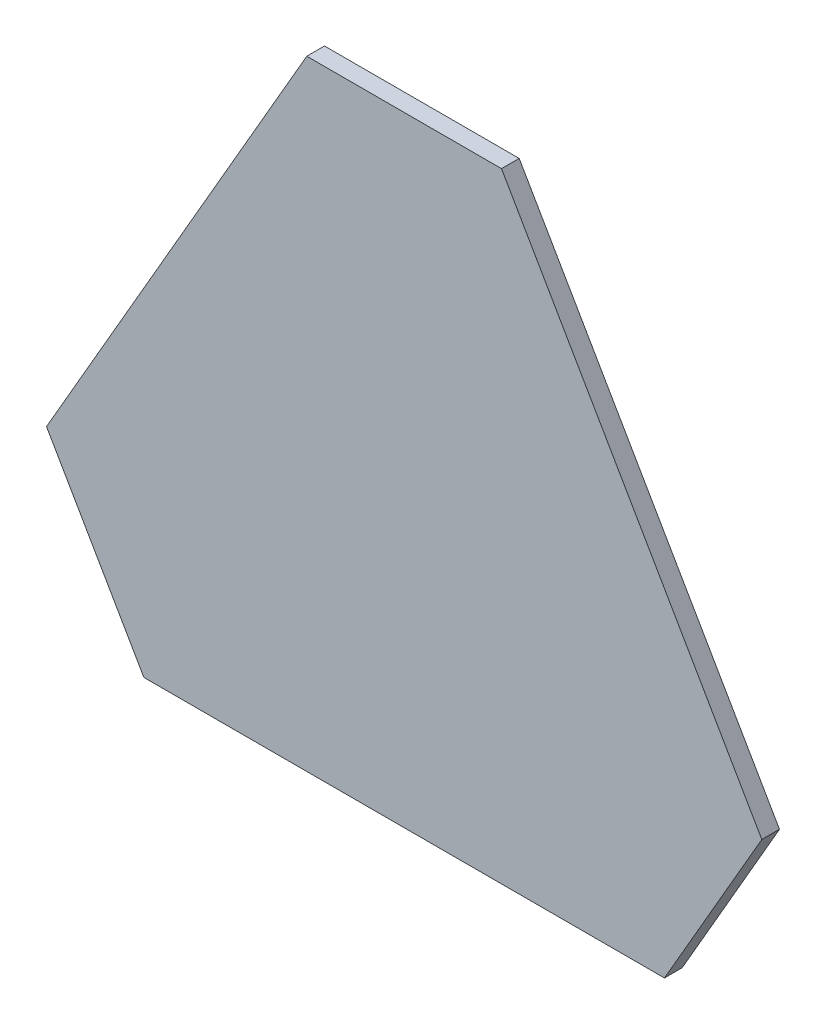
ISO-10303-21;
HEADER;
FILE_DESCRIPTION(('STEP AP214'),'2;1');
FILE_NAME('part.step','',(''),(''),'','','');
FILE_SCHEMA(('AUTOMOTIVE_DESIGN { 1 0 10303 214 1 1 1 1 }'));
ENDSEC;
DATA;
#1=APPLICATION_CONTEXT('core data for automotive mechanical design processes');
#2=APPLICATION_PROTOCOL_DEFINITION('international standard','automotive_design',2000,#1);
#3=PRODUCT_CONTEXT('',#1,'mechanical');
#4=PRODUCT('Part','Part','',(#3));
#5=PRODUCT_RELATED_PRODUCT_CATEGORY('part','',(#4));
#6=PRODUCT_DEFINITION_FORMATION('','',#4);
#7=PRODUCT_DEFINITION_CONTEXT('part definition',#1,'design');
#8=PRODUCT_DEFINITION('design','',#6,#7);
#9=PRODUCT_DEFINITION_SHAPE('','',#8);
#10=(LENGTH_UNIT() NAMED_UNIT(*) SI_UNIT(.MILLI.,.METRE.));
#11=(NAMED_UNIT(*) PLANE_ANGLE_UNIT() SI_UNIT($,.RADIAN.));
#12=(NAMED_UNIT(*) SI_UNIT($,.STERADIAN.) SOLID_ANGLE_UNIT());
#13=UNCERTAINTY_MEASURE_WITH_UNIT(LENGTH_MEASURE(1.E-05),#10,'distance_accuracy_value','');
#14=(GEOMETRIC_REPRESENTATION_CONTEXT(3) GLOBAL_UNCERTAINTY_ASSIGNED_CONTEXT((#13)) GLOBAL_UNIT_ASSIGNED_CONTEXT((#10,
#11,#12)) REPRESENTATION_CONTEXT('',''));
#15=CARTESIAN_POINT('',(0.,0.,0.));
#16=DIRECTION('',(0.,0.,1.));
#17=DIRECTION('',(1.,0.,0.));
#18=AXIS2_PLACEMENT_3D('',#15,#16,#17);
#19=CARTESIAN_POINT('',(-202.07259421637,-53.1581370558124,10.));
#20=DIRECTION('',(0.86602540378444,-0.499999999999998,0.));
#21=DIRECTION('',(0.499999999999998,0.86602540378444,0.));
#22=AXIS2_PLACEMENT_3D('',#19,#20,#21);
#23=PLANE('',#22);
#24=DIRECTION('',(-0.499999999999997,-0.86602540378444,0.));
#25=VECTOR('',#24,1.);
#26=CARTESIAN_POINT('',(-202.07259421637,-53.1581370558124,0.));
#27=LINE('',#26,#25);
#28=CARTESIAN_POINT('',(-54.9999999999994,201.579068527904,0.));
#29=VERTEX_POINT('',#28);
#30=CARTESIAN_POINT('',(-202.07259421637,-53.1581370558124,0.));
#31=VERTEX_POINT('',#30);
#32=EDGE_CURVE('E134',#29,#31,#27,.T.);
#33=ORIENTED_EDGE('',*,*,#32,.T.);
#34=DIRECTION('',(0.,0.,-1.));
#35=VECTOR('',#34,1.);
#36=CARTESIAN_POINT('',(-202.07259421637,-53.1581370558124,10.));
#37=LINE('',#36,#35);
#38=CARTESIAN_POINT('',(-202.07259421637,-53.1581370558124,10.));
#39=VERTEX_POINT('',#38);
#40=EDGE_CURVE('E11',#39,#31,#37,.T.);
#41=ORIENTED_EDGE('',*,*,#40,.F.);
#42=DIRECTION('',(-0.499999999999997,-0.86602540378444,0.));
#43=VECTOR('',#42,1.);
#44=CARTESIAN_POINT('',(-202.07259421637,-53.1581370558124,10.));
#45=LINE('',#44,#43);
#46=CARTESIAN_POINT('',(-54.9999999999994,201.579068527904,10.));
#47=VERTEX_POINT('',#46);
#48=EDGE_CURVE('E150',#47,#39,#45,.T.);
#49=ORIENTED_EDGE('',*,*,#48,.F.);
#50=DIRECTION('',(0.,0.,-1.));
#51=VECTOR('',#50,1.);
#52=CARTESIAN_POINT('',(-54.9999999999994,201.579068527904,10.));
#53=LINE('',#52,#51);
#54=EDGE_CURVE('E130',#47,#29,#53,.T.);
#55=ORIENTED_EDGE('',*,*,#54,.T.);
#56=EDGE_LOOP('',(#33,#41,#49,#55));
#57=FACE_BOUND('',#56,.T.);
#58=ADVANCED_FACE('F45',(#57),#23,.F.);
#59=CARTESIAN_POINT('',(-147.072594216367,-148.420931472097,10.));
#60=DIRECTION('',(0.866025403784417,0.500000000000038,0.));
#61=DIRECTION('',(-0.500000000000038,0.866025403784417,0.));
#62=AXIS2_PLACEMENT_3D('',#59,#60,#61);
#63=PLANE('',#62);
#64=DIRECTION('',(0.500000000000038,-0.866025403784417,0.));
#65=VECTOR('',#64,1.);
#66=CARTESIAN_POINT('',(-147.072594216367,-148.420931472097,0.));
#67=LINE('',#66,#65);
#68=CARTESIAN_POINT('',(-147.072594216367,-148.420931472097,0.));
#69=VERTEX_POINT('',#68);
#70=EDGE_CURVE('E138',#31,#69,#67,.T.);
#71=ORIENTED_EDGE('',*,*,#70,.T.);
#72=DIRECTION('',(0.,0.,-1.));
#73=VECTOR('',#72,1.);
#74=CARTESIAN_POINT('',(-147.072594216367,-148.420931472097,10.));
#75=LINE('',#74,#73);
#76=CARTESIAN_POINT('',(-147.072594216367,-148.420931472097,10.));
#77=VERTEX_POINT('',#76);
#78=EDGE_CURVE('E54',#77,#69,#75,.T.);
#79=ORIENTED_EDGE('',*,*,#78,.F.);
#80=DIRECTION('',(0.500000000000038,-0.866025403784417,0.));
#81=VECTOR('',#80,1.);
#82=CARTESIAN_POINT('',(-147.072594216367,-148.420931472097,10.));
#83=LINE('',#82,#81);
#84=EDGE_CURVE('E99',#39,#77,#83,.T.);
#85=ORIENTED_EDGE('',*,*,#84,.F.);
#86=ORIENTED_EDGE('',*,*,#40,.T.);
#87=EDGE_LOOP('',(#71,#79,#85,#86));
#88=FACE_BOUND('',#87,.T.);
#89=ADVANCED_FACE('F178',(#88),#63,.F.);
#90=CARTESIAN_POINT('',(-147.072594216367,-148.420931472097,10.));
#91=DIRECTION('',(0.,1.,0.));
#92=DIRECTION('',(0.,0.,1.));
#93=AXIS2_PLACEMENT_3D('',#90,#91,#92);
#94=PLANE('',#93);
#95=DIRECTION('',(1.,0.,0.));
#96=VECTOR('',#95,1.);
#97=CARTESIAN_POINT('',(-147.072594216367,-148.420931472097,0.));
#98=LINE('',#97,#96);
#99=CARTESIAN_POINT('',(147.072594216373,-148.420931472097,0.));
#100=VERTEX_POINT('',#99);
#101=EDGE_CURVE('E141',#69,#100,#98,.T.);
#102=ORIENTED_EDGE('',*,*,#101,.T.);
#103=DIRECTION('',(0.,0.,-1.));
#104=VECTOR('',#103,1.);
#105=CARTESIAN_POINT('',(147.072594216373,-148.420931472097,10.));
#106=LINE('',#105,#104);
#107=CARTESIAN_POINT('',(147.072594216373,-148.420931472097,10.));
#108=VERTEX_POINT('',#107);
#109=EDGE_CURVE('E123',#108,#100,#106,.T.);
#110=ORIENTED_EDGE('',*,*,#109,.F.);
#111=DIRECTION('',(1.,0.,0.));
#112=VECTOR('',#111,1.);
#113=CARTESIAN_POINT('',(-147.072594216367,-148.420931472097,10.));
#114=LINE('',#113,#112);
#115=EDGE_CURVE('E112',#77,#108,#114,.T.);
#116=ORIENTED_EDGE('',*,*,#115,.F.);
#117=ORIENTED_EDGE('',*,*,#78,.T.);
#118=EDGE_LOOP('',(#102,#110,#116,#117));
#119=FACE_BOUND('',#118,.T.);
#120=ADVANCED_FACE('F160',(#119),#94,.F.);
#121=CARTESIAN_POINT('',(147.072594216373,-148.420931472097,10.));
#122=DIRECTION('',(-0.86602540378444,0.499999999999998,0.));
#123=DIRECTION('',(-0.499999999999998,-0.86602540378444,0.));
#124=AXIS2_PLACEMENT_3D('',#121,#122,#123);
#125=PLANE('',#124);
#126=DIRECTION('',(0.499999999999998,0.86602540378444,0.));
#127=VECTOR('',#126,1.);
#128=CARTESIAN_POINT('',(147.072594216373,-148.420931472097,0.));
#129=LINE('',#128,#127);
#130=CARTESIAN_POINT('',(202.072594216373,-53.1581370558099,0.));
#131=VERTEX_POINT('',#130);
#132=EDGE_CURVE('E121',#100,#131,#129,.T.);
#133=ORIENTED_EDGE('',*,*,#132,.T.);
#134=DIRECTION('',(0.,0.,-1.));
#135=VECTOR('',#134,1.);
#136=CARTESIAN_POINT('',(202.072594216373,-53.1581370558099,10.));
#137=LINE('',#136,#135);
#138=CARTESIAN_POINT('',(202.072594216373,-53.1581370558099,10.));
#139=VERTEX_POINT('',#138);
#140=EDGE_CURVE('E118',#139,#131,#137,.T.);
#141=ORIENTED_EDGE('',*,*,#140,.F.);
#142=DIRECTION('',(0.499999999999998,0.86602540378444,0.));
#143=VECTOR('',#142,1.);
#144=CARTESIAN_POINT('',(147.072594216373,-148.420931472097,10.));
#145=LINE('',#144,#143);
#146=EDGE_CURVE('E106',#108,#139,#145,.T.);
#147=ORIENTED_EDGE('',*,*,#146,.F.);
#148=ORIENTED_EDGE('',*,*,#109,.T.);
#149=EDGE_LOOP('',(#133,#141,#147,#148));
#150=FACE_BOUND('',#149,.T.);
#151=ADVANCED_FACE('F119',(#150),#125,.F.);
#152=CARTESIAN_POINT('',(202.072594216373,-53.1581370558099,10.));
#153=DIRECTION('',(-0.866025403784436,-0.500000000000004,0.));
#154=DIRECTION('',(0.500000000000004,-0.866025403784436,0.));
#155=AXIS2_PLACEMENT_3D('',#152,#153,#154);
#156=PLANE('',#155);
#157=DIRECTION('',(-0.500000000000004,0.866025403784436,0.));
#158=VECTOR('',#157,1.);
#159=CARTESIAN_POINT('',(202.072594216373,-53.1581370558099,0.));
#160=LINE('',#159,#158);
#161=CARTESIAN_POINT('',(55.0000000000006,201.579068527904,0.));
#162=VERTEX_POINT('',#161);
#163=EDGE_CURVE('E85',#131,#162,#160,.T.);
#164=ORIENTED_EDGE('',*,*,#163,.T.);
#165=DIRECTION('',(0.,0.,-1.));
#166=VECTOR('',#165,1.);
#167=CARTESIAN_POINT('',(55.0000000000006,201.579068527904,10.));
#168=LINE('',#167,#166);
#169=CARTESIAN_POINT('',(55.0000000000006,201.579068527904,10.));
#170=VERTEX_POINT('',#169);
#171=EDGE_CURVE('E124',#170,#162,#168,.T.);
#172=ORIENTED_EDGE('',*,*,#171,.F.);
#173=DIRECTION('',(-0.500000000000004,0.866025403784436,0.));
#174=VECTOR('',#173,1.);
#175=CARTESIAN_POINT('',(202.072594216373,-53.1581370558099,10.));
#176=LINE('',#175,#174);
#177=EDGE_CURVE('E110',#139,#170,#176,.T.);
#178=ORIENTED_EDGE('',*,*,#177,.F.);
#179=ORIENTED_EDGE('',*,*,#140,.T.);
#180=EDGE_LOOP('',(#164,#172,#178,#179));
#181=FACE_BOUND('',#180,.T.);
#182=ADVANCED_FACE('F126',(#181),#156,.F.);
#183=CARTESIAN_POINT('',(-54.9999999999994,201.579068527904,10.));
#184=DIRECTION('',(0.,-1.,0.));
#185=DIRECTION('',(0.,0.,-1.));
#186=AXIS2_PLACEMENT_3D('',#183,#184,#185);
#187=PLANE('',#186);
#188=DIRECTION('',(-1.,0.,0.));
#189=VECTOR('',#188,1.);
#190=CARTESIAN_POINT('',(-54.9999999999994,201.579068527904,0.));
#191=LINE('',#190,#189);
#192=EDGE_CURVE('E91',#162,#29,#191,.T.);
#193=ORIENTED_EDGE('',*,*,#192,.T.);
#194=ORIENTED_EDGE('',*,*,#54,.F.);
#195=DIRECTION('',(-1.,0.,0.));
#196=VECTOR('',#195,1.);
#197=CARTESIAN_POINT('',(-54.9999999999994,201.579068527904,10.));
#198=LINE('',#197,#196);
#199=EDGE_CURVE('E62',#170,#47,#198,.T.);
#200=ORIENTED_EDGE('',*,*,#199,.F.);
#201=ORIENTED_EDGE('',*,*,#171,.T.);
#202=EDGE_LOOP('',(#193,#194,#200,#201));
#203=FACE_BOUND('',#202,.T.);
#204=ADVANCED_FACE('F167',(#203),#187,.F.);
#205=CARTESIAN_POINT('',(0.,0.,10.));
#206=DIRECTION('',(0.,0.,-1.));
#207=DIRECTION('',(-1.,0.,0.));
#208=AXIS2_PLACEMENT_3D('',#205,#206,#207);
#209=PLANE('',#208);
#210=ORIENTED_EDGE('',*,*,#48,.T.);
#211=ORIENTED_EDGE('',*,*,#84,.T.);
#212=ORIENTED_EDGE('',*,*,#115,.T.);
#213=ORIENTED_EDGE('',*,*,#146,.T.);
#214=ORIENTED_EDGE('',*,*,#177,.T.);
#215=ORIENTED_EDGE('',*,*,#199,.T.);
#216=EDGE_LOOP('',(#210,#211,#212,#213,#214,#215));
#217=FACE_BOUND('',#216,.T.);
#218=ADVANCED_FACE('F108',(#217),#209,.F.);
#219=CARTESIAN_POINT('',(0.,0.,0.));
#220=DIRECTION('',(0.,0.,-1.));
#221=DIRECTION('',(-1.,0.,0.));
#222=AXIS2_PLACEMENT_3D('',#219,#220,#221);
#223=PLANE('',#222);
#224=ORIENTED_EDGE('',*,*,#32,.F.);
#225=ORIENTED_EDGE('',*,*,#192,.F.);
#226=ORIENTED_EDGE('',*,*,#163,.F.);
#227=ORIENTED_EDGE('',*,*,#132,.F.);
#228=ORIENTED_EDGE('',*,*,#101,.F.);
#229=ORIENTED_EDGE('',*,*,#70,.F.);
#230=EDGE_LOOP('',(#224,#225,#226,#227,#228,#229));
#231=FACE_BOUND('',#230,.T.);
#232=ADVANCED_FACE('F163',(#231),#223,.T.);
#233=CLOSED_SHELL('',(#58,#89,#120,#151,#182,#204,#218,#232));
#234=MANIFOLD_SOLID_BREP('B2',#233);
#235=ADVANCED_BREP_SHAPE_REPRESENTATION('',(#18,#234),#14);
#236=SHAPE_DEFINITION_REPRESENTATION(#9,#235);
ENDSEC;
END-ISO-10303-21;
